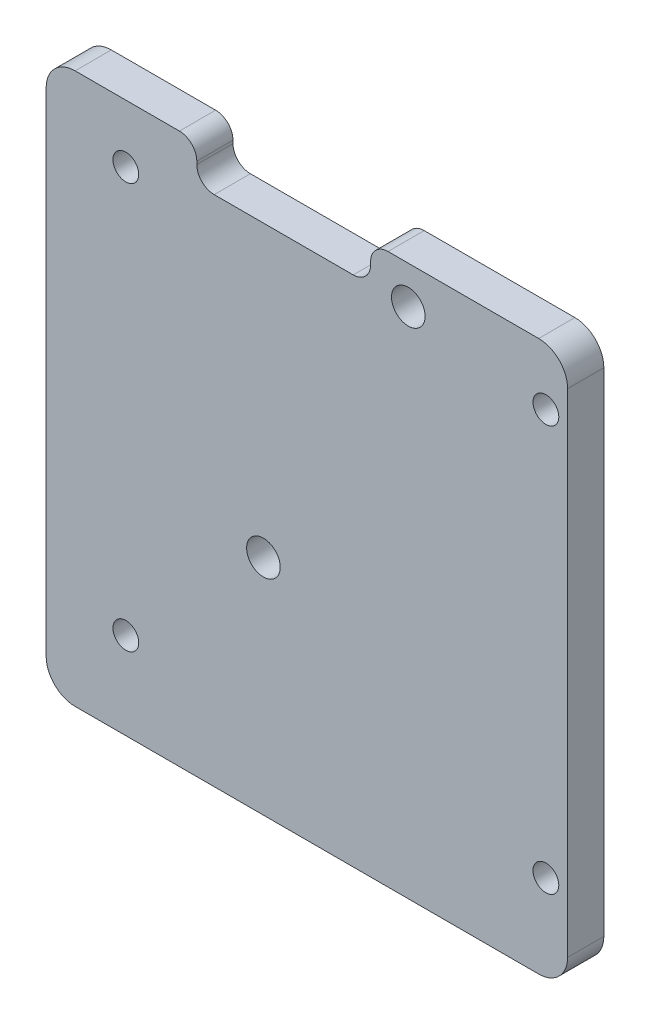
from build123d import *

# Parameters (mm, degrees)
SKETCH1_W             = 45.72
SKETCH1_H             = 48.26
BOSS_EXTRUDE1_DEPTH   = 3.175
F_4_CLEARANCE_HOLE1_D = 2.9464
SKETCH6_W             = 15.24
SKETCH6_H             = 6.604
CUT_EXTRUDE1_DEPTH    = 34.390374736
FILLET1_R             = 1.524
F_2_CLEARANCE_HOLE1_D = 2.2606
FILLET2_R             = 2.54


with BuildPart() as part:
    # Sketch1 → Boss-Extrude1 (new body)
    with BuildSketch(Plane.XY):
        Rectangle(SKETCH1_W, SKETCH1_H)
    extrude(amount=BOSS_EXTRUDE1_DEPTH)

    # 4 Clearance Hole1 (through all)
    with Locations(Plane.XY.offset(3.175)):
        with Locations((-3.81, -4.572), (8.89, 20.828)):
            Hole(F_4_CLEARANCE_HOLE1_D / 2)

    # Sketch6 → Cut-Extrude1 (cut, through all)
    with BuildSketch(Plane.XY.offset(3.175)):
        with Locations((-2.032, 24.13)):
            Rectangle(SKETCH6_W, SKETCH6_H)
    extrude(amount=-CUT_EXTRUDE1_DEPTH, mode=Mode.SUBTRACT)

    # Fillet1
    fillet1_edges = [part.edges().sort_by_distance(p)[0] for p in [
        (-9.652, 24.13, 1.5875),
        (-9.652, 20.828, 1.5875),
        (5.588, 24.13, 1.5875),
        (5.588, 20.828, 1.5875),
    ]]
    fillet(fillet1_edges, radius=FILLET1_R)

    # 2 Clearance Hole1 (through all)
    with Locations(Plane.XY.offset(3.175)):
        with Locations((20.955, -16.51), (-15.875, 19.05), (20.955, 19.05), (-15.875, -16.51)):
            Hole(F_2_CLEARANCE_HOLE1_D / 2)

    # Fillet2
    fillet2_edges = [part.edges().sort_by_distance(p)[0] for p in [
        (22.86, -24.13, 1.5875),
        (-22.86, -24.13, 1.5875),
        (-22.86, 24.13, 1.5875),
        (22.86, 24.13, 1.5875),
    ]]
    fillet(fillet2_edges, radius=FILLET2_R)


solid = part.part
